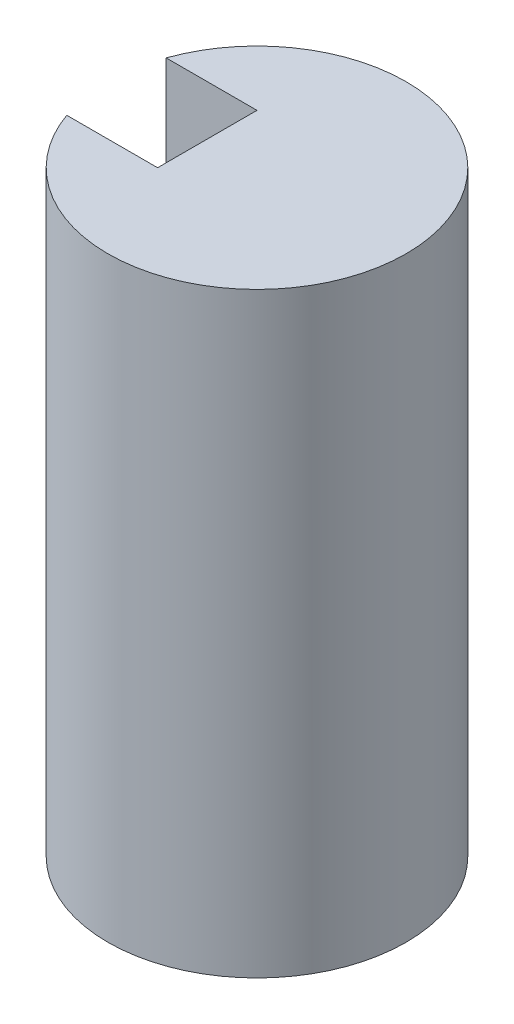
ISO-10303-21;
HEADER;
FILE_DESCRIPTION(('STEP AP214'),'2;1');
FILE_NAME('part.step','',(''),(''),'','','');
FILE_SCHEMA(('AUTOMOTIVE_DESIGN { 1 0 10303 214 1 1 1 1 }'));
ENDSEC;
DATA;
#1=APPLICATION_CONTEXT('core data for automotive mechanical design processes');
#2=APPLICATION_PROTOCOL_DEFINITION('international standard','automotive_design',2000,#1);
#3=PRODUCT_CONTEXT('',#1,'mechanical');
#4=PRODUCT('Part','Part','',(#3));
#5=PRODUCT_RELATED_PRODUCT_CATEGORY('part','',(#4));
#6=PRODUCT_DEFINITION_FORMATION('','',#4);
#7=PRODUCT_DEFINITION_CONTEXT('part definition',#1,'design');
#8=PRODUCT_DEFINITION('design','',#6,#7);
#9=PRODUCT_DEFINITION_SHAPE('','',#8);
#10=(LENGTH_UNIT() NAMED_UNIT(*) SI_UNIT(.MILLI.,.METRE.));
#11=(NAMED_UNIT(*) PLANE_ANGLE_UNIT() SI_UNIT($,.RADIAN.));
#12=(NAMED_UNIT(*) SI_UNIT($,.STERADIAN.) SOLID_ANGLE_UNIT());
#13=UNCERTAINTY_MEASURE_WITH_UNIT(LENGTH_MEASURE(1.E-05),#10,'distance_accuracy_value','');
#14=(GEOMETRIC_REPRESENTATION_CONTEXT(3) GLOBAL_UNCERTAINTY_ASSIGNED_CONTEXT((#13)) GLOBAL_UNIT_ASSIGNED_CONTEXT((#10,
#11,#12)) REPRESENTATION_CONTEXT('',''));
#15=CARTESIAN_POINT('',(0.,0.,0.));
#16=DIRECTION('',(0.,0.,1.));
#17=DIRECTION('',(1.,0.,0.));
#18=AXIS2_PLACEMENT_3D('',#15,#16,#17);
#19=CARTESIAN_POINT('',(1.5,6.,0.));
#20=DIRECTION('',(0.,-1.,0.));
#21=DIRECTION('',(0.,0.,-1.));
#22=AXIS2_PLACEMENT_3D('',#19,#20,#21);
#23=CYLINDRICAL_SURFACE('',#22,1.5);
#24=CARTESIAN_POINT('',(1.5,0.,0.));
#25=DIRECTION('',(0.,1.,0.));
#26=DIRECTION('',(0.,0.,1.));
#27=AXIS2_PLACEMENT_3D('',#24,#25,#26);
#28=CIRCLE('',#27,1.5);
#29=CARTESIAN_POINT('',(1.5,0.,1.5));
#30=VERTEX_POINT('',#29);
#31=EDGE_CURVE('E106',#30,#30,#28,.T.);
#32=ORIENTED_EDGE('',*,*,#31,.T.);
#33=EDGE_LOOP('',(#32));
#34=FACE_BOUND('',#33,.T.);
#35=DIRECTION('',(0.,-1.,0.));
#36=VECTOR('',#35,1.);
#37=CARTESIAN_POINT('',(0.085786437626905,6.,0.5));
#38=LINE('',#37,#36);
#39=CARTESIAN_POINT('',(0.0857864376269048,6.,0.5));
#40=VERTEX_POINT('',#39);
#41=CARTESIAN_POINT('',(0.085786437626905,3.,0.499999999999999));
#42=VERTEX_POINT('',#41);
#43=EDGE_CURVE('E100',#40,#42,#38,.T.);
#44=ORIENTED_EDGE('',*,*,#43,.T.);
#45=CARTESIAN_POINT('',(1.5,3.,0.));
#46=DIRECTION('',(0.,-1.,0.));
#47=DIRECTION('',(0.,0.,-1.));
#48=AXIS2_PLACEMENT_3D('',#45,#46,#47);
#49=CIRCLE('',#48,1.5);
#50=CARTESIAN_POINT('',(0.0857864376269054,3.,-0.5));
#51=VERTEX_POINT('',#50);
#52=EDGE_CURVE('E11',#42,#51,#49,.T.);
#53=ORIENTED_EDGE('',*,*,#52,.T.);
#54=DIRECTION('',(0.,-1.,0.));
#55=VECTOR('',#54,1.);
#56=CARTESIAN_POINT('',(0.0857864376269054,6.,-0.5));
#57=LINE('',#56,#55);
#58=CARTESIAN_POINT('',(0.0857864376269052,6.,-0.5));
#59=VERTEX_POINT('',#58);
#60=EDGE_CURVE('E59',#59,#51,#57,.T.);
#61=ORIENTED_EDGE('',*,*,#60,.F.);
#62=CARTESIAN_POINT('',(1.5,6.,0.));
#63=DIRECTION('',(0.,1.,0.));
#64=DIRECTION('',(0.,0.,1.));
#65=AXIS2_PLACEMENT_3D('',#62,#63,#64);
#66=CIRCLE('',#65,1.5);
#67=EDGE_CURVE('E44',#40,#59,#66,.T.);
#68=ORIENTED_EDGE('',*,*,#67,.F.);
#69=EDGE_LOOP('',(#44,#53,#61,#68));
#70=FACE_BOUND('',#69,.T.);
#71=ADVANCED_FACE('F37',(#34,#70),#23,.T.);
#72=CARTESIAN_POINT('',(1.5,6.,0.));
#73=DIRECTION('',(0.,1.,0.));
#74=DIRECTION('',(0.,0.,1.));
#75=AXIS2_PLACEMENT_3D('',#72,#73,#74);
#76=PLANE('',#75);
#77=ORIENTED_EDGE('',*,*,#67,.T.);
#78=DIRECTION('',(-1.,0.,0.));
#79=VECTOR('',#78,1.);
#80=CARTESIAN_POINT('',(1.,6.,-0.5));
#81=LINE('',#80,#79);
#82=CARTESIAN_POINT('',(1.,6.,-0.5));
#83=VERTEX_POINT('',#82);
#84=EDGE_CURVE('E101',#83,#59,#81,.T.);
#85=ORIENTED_EDGE('',*,*,#84,.F.);
#86=DIRECTION('',(0.,0.,1.));
#87=VECTOR('',#86,1.);
#88=CARTESIAN_POINT('',(1.,6.,-0.5));
#89=LINE('',#88,#87);
#90=CARTESIAN_POINT('',(1.,6.,0.5));
#91=VERTEX_POINT('',#90);
#92=EDGE_CURVE('E90',#83,#91,#89,.T.);
#93=ORIENTED_EDGE('',*,*,#92,.T.);
#94=DIRECTION('',(-1.,0.,0.));
#95=VECTOR('',#94,1.);
#96=CARTESIAN_POINT('',(1.,6.,0.5));
#97=LINE('',#96,#95);
#98=EDGE_CURVE('E84',#91,#40,#97,.T.);
#99=ORIENTED_EDGE('',*,*,#98,.T.);
#100=EDGE_LOOP('',(#77,#85,#93,#99));
#101=FACE_BOUND('',#100,.T.);
#102=ADVANCED_FACE('F115',(#101),#76,.T.);
#103=CARTESIAN_POINT('',(1.5,0.,0.));
#104=DIRECTION('',(0.,1.,0.));
#105=DIRECTION('',(0.,0.,1.));
#106=AXIS2_PLACEMENT_3D('',#103,#104,#105);
#107=PLANE('',#106);
#108=ORIENTED_EDGE('',*,*,#31,.F.);
#109=EDGE_LOOP('',(#108));
#110=FACE_BOUND('',#109,.T.);
#111=ADVANCED_FACE('F113',(#110),#107,.F.);
#112=CARTESIAN_POINT('',(1.,3.,-0.5));
#113=DIRECTION('',(0.,-1.,0.));
#114=DIRECTION('',(0.,0.,-1.));
#115=AXIS2_PLACEMENT_3D('',#112,#113,#114);
#116=PLANE('',#115);
#117=DIRECTION('',(-1.,0.,0.));
#118=VECTOR('',#117,1.);
#119=CARTESIAN_POINT('',(1.,3.,0.499999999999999));
#120=LINE('',#119,#118);
#121=CARTESIAN_POINT('',(1.,3.,0.499999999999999));
#122=VERTEX_POINT('',#121);
#123=EDGE_CURVE('E79',#122,#42,#120,.T.);
#124=ORIENTED_EDGE('',*,*,#123,.F.);
#125=DIRECTION('',(0.,0.,1.));
#126=VECTOR('',#125,1.);
#127=CARTESIAN_POINT('',(1.,3.,-0.5));
#128=LINE('',#127,#126);
#129=CARTESIAN_POINT('',(1.,3.,-0.5));
#130=VERTEX_POINT('',#129);
#131=EDGE_CURVE('E81',#130,#122,#128,.T.);
#132=ORIENTED_EDGE('',*,*,#131,.F.);
#133=DIRECTION('',(-1.,0.,0.));
#134=VECTOR('',#133,1.);
#135=CARTESIAN_POINT('',(1.,3.,-0.5));
#136=LINE('',#135,#134);
#137=EDGE_CURVE('E98',#130,#51,#136,.T.);
#138=ORIENTED_EDGE('',*,*,#137,.T.);
#139=ORIENTED_EDGE('',*,*,#52,.F.);
#140=EDGE_LOOP('',(#124,#132,#138,#139));
#141=FACE_BOUND('',#140,.T.);
#142=ADVANCED_FACE('F80',(#141),#116,.F.);
#143=CARTESIAN_POINT('',(1.,3.,-0.5));
#144=DIRECTION('',(0.,0.,1.));
#145=DIRECTION('',(1.,0.,0.));
#146=AXIS2_PLACEMENT_3D('',#143,#144,#145);
#147=PLANE('',#146);
#148=ORIENTED_EDGE('',*,*,#60,.T.);
#149=ORIENTED_EDGE('',*,*,#137,.F.);
#150=DIRECTION('',(0.,1.,0.));
#151=VECTOR('',#150,1.);
#152=CARTESIAN_POINT('',(1.,3.,-0.5));
#153=LINE('',#152,#151);
#154=EDGE_CURVE('E85',#130,#83,#153,.T.);
#155=ORIENTED_EDGE('',*,*,#154,.T.);
#156=ORIENTED_EDGE('',*,*,#84,.T.);
#157=EDGE_LOOP('',(#148,#149,#155,#156));
#158=FACE_BOUND('',#157,.T.);
#159=ADVANCED_FACE('F120',(#158),#147,.T.);
#160=CARTESIAN_POINT('',(1.,3.,0.499999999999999));
#161=DIRECTION('',(0.,0.,1.));
#162=DIRECTION('',(0.,-1.,0.));
#163=AXIS2_PLACEMENT_3D('',#160,#161,#162);
#164=PLANE('',#163);
#165=ORIENTED_EDGE('',*,*,#98,.F.);
#166=DIRECTION('',(0.,1.,0.));
#167=VECTOR('',#166,1.);
#168=CARTESIAN_POINT('',(1.,3.,0.499999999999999));
#169=LINE('',#168,#167);
#170=EDGE_CURVE('E51',#122,#91,#169,.T.);
#171=ORIENTED_EDGE('',*,*,#170,.F.);
#172=ORIENTED_EDGE('',*,*,#123,.T.);
#173=ORIENTED_EDGE('',*,*,#43,.F.);
#174=EDGE_LOOP('',(#165,#171,#172,#173));
#175=FACE_BOUND('',#174,.T.);
#176=ADVANCED_FACE('F87',(#175),#164,.F.);
#177=CARTESIAN_POINT('',(1.,0.,0.));
#178=DIRECTION('',(-1.,0.,0.));
#179=DIRECTION('',(0.,0.,1.));
#180=AXIS2_PLACEMENT_3D('',#177,#178,#179);
#181=PLANE('',#180);
#182=ORIENTED_EDGE('',*,*,#131,.T.);
#183=ORIENTED_EDGE('',*,*,#170,.T.);
#184=ORIENTED_EDGE('',*,*,#92,.F.);
#185=ORIENTED_EDGE('',*,*,#154,.F.);
#186=EDGE_LOOP('',(#182,#183,#184,#185));
#187=FACE_BOUND('',#186,.T.);
#188=ADVANCED_FACE('F93',(#187),#181,.T.);
#189=CLOSED_SHELL('',(#71,#102,#111,#142,#159,#176,#188));
#190=MANIFOLD_SOLID_BREP('B2',#189);
#191=ADVANCED_BREP_SHAPE_REPRESENTATION('',(#18,#190),#14);
#192=SHAPE_DEFINITION_REPRESENTATION(#9,#191);
ENDSEC;
END-ISO-10303-21;
